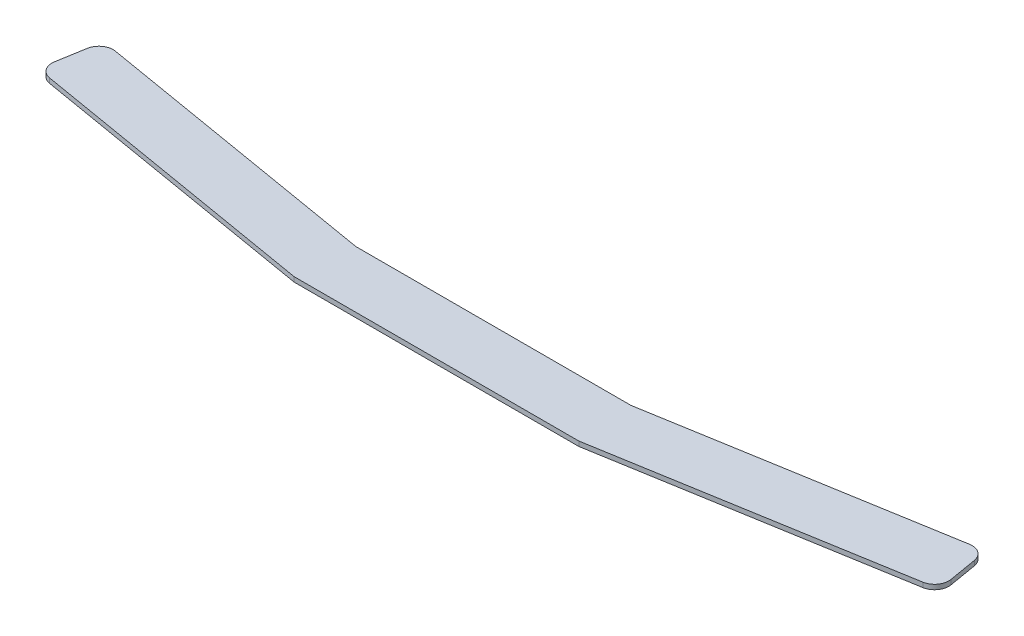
from build123d import *

# Parameters (mm, degrees)
EXTRUDE_1_DEPTH = 1


with BuildPart() as part:
    # Sketch 1 → Extrude 1 (new body)
    with BuildSketch(Plane(origin=(0, 0, 0), x_dir=(1, 0, 0), z_dir=(0, 1, 0))):
        with BuildLine():
            Line((-30, 0), (30, 0))
            Line((30, 0), (92.042057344, 10.499425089))
            ThreePointArc((92.042057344, 10.499425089), (93.987023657, 11.719746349), (94.499425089, 13.957942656))
            Line((94.499425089, 13.957942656), (93.498275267, 19.873827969))
            ThreePointArc((93.498275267, 19.873827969), (92.277954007, 21.818794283), (90.039757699, 22.331195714))
            Line((90.039757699, 22.331195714), (28.991783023, 12))
            Line((28.991783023, 12), (-28.991783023, 12))
            Line((-28.991783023, 12), (-90.039757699, 22.331195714))
            ThreePointArc((-90.039757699, 22.331195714), (-92.277954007, 21.818794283), (-93.498275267, 19.873827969))
            Line((-93.498275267, 19.873827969), (-94.499425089, 13.957942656))
            ThreePointArc((-94.499425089, 13.957942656), (-93.987023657, 11.719746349), (-92.042057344, 10.499425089))
            Line((-92.042057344, 10.499425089), (-30, 0))
        make_face()
    extrude(amount=EXTRUDE_1_DEPTH)


solid = part.part
